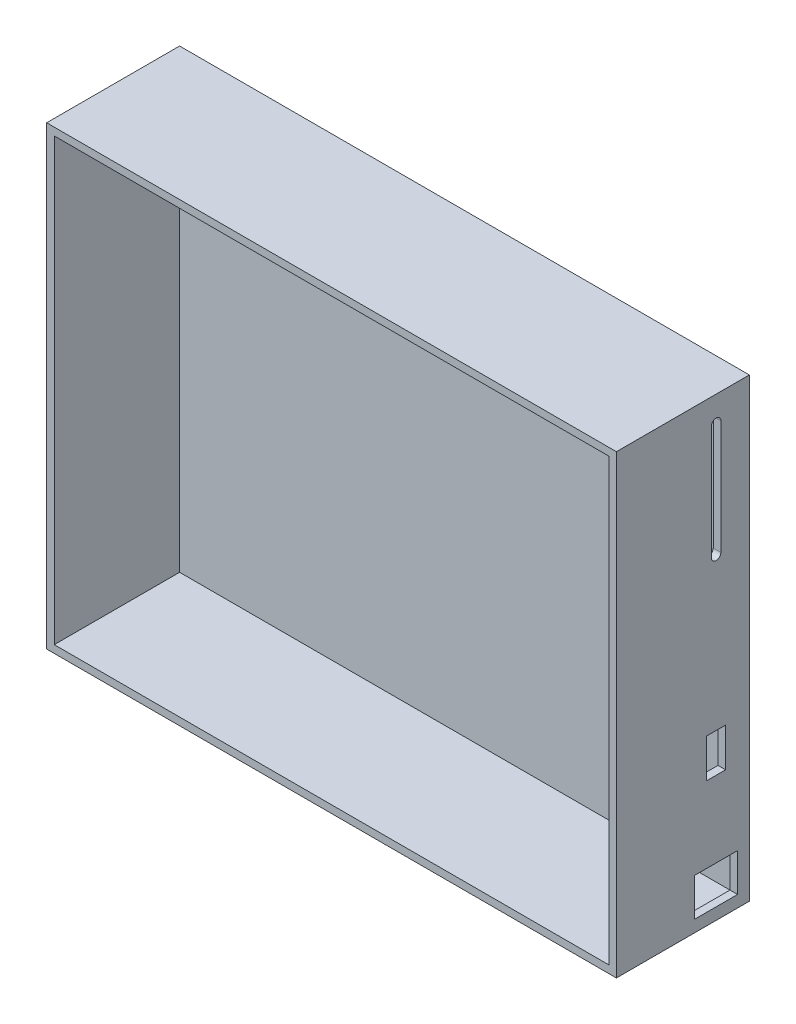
ISO-10303-21;
HEADER;
FILE_DESCRIPTION(('STEP AP214'),'2;1');
FILE_NAME('part.step','',(''),(''),'','','');
FILE_SCHEMA(('AUTOMOTIVE_DESIGN { 1 0 10303 214 1 1 1 1 }'));
ENDSEC;
DATA;
#1=APPLICATION_CONTEXT('core data for automotive mechanical design processes');
#2=APPLICATION_PROTOCOL_DEFINITION('international standard','automotive_design',2000,#1);
#3=PRODUCT_CONTEXT('',#1,'mechanical');
#4=PRODUCT('Part','Part','',(#3));
#5=PRODUCT_RELATED_PRODUCT_CATEGORY('part','',(#4));
#6=PRODUCT_DEFINITION_FORMATION('','',#4);
#7=PRODUCT_DEFINITION_CONTEXT('part definition',#1,'design');
#8=PRODUCT_DEFINITION('design','',#6,#7);
#9=PRODUCT_DEFINITION_SHAPE('','',#8);
#10=(LENGTH_UNIT() NAMED_UNIT(*) SI_UNIT(.MILLI.,.METRE.));
#11=(NAMED_UNIT(*) PLANE_ANGLE_UNIT() SI_UNIT($,.RADIAN.));
#12=(NAMED_UNIT(*) SI_UNIT($,.STERADIAN.) SOLID_ANGLE_UNIT());
#13=UNCERTAINTY_MEASURE_WITH_UNIT(LENGTH_MEASURE(1.E-05),#10,'distance_accuracy_value','');
#14=(GEOMETRIC_REPRESENTATION_CONTEXT(3) GLOBAL_UNCERTAINTY_ASSIGNED_CONTEXT((#13)) GLOBAL_UNIT_ASSIGNED_CONTEXT((#10,
#11,#12)) REPRESENTATION_CONTEXT('',''));
#15=CARTESIAN_POINT('',(0.,0.,0.));
#16=DIRECTION('',(0.,0.,1.));
#17=DIRECTION('',(1.,0.,0.));
#18=AXIS2_PLACEMENT_3D('',#15,#16,#17);
#19=CARTESIAN_POINT('',(-95.2500000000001,-76.2,22.225));
#20=DIRECTION('',(1.,0.,0.));
#21=DIRECTION('',(0.,0.,-1.));
#22=AXIS2_PLACEMENT_3D('',#19,#20,#21);
#23=PLANE('',#22);
#24=DIRECTION('',(0.,-1.,0.));
#25=VECTOR('',#24,1.);
#26=CARTESIAN_POINT('',(-95.2500000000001,-76.2,-22.225));
#27=LINE('',#26,#25);
#28=CARTESIAN_POINT('',(-95.2500000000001,76.2,-22.225));
#29=VERTEX_POINT('',#28);
#30=CARTESIAN_POINT('',(-95.2500000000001,-76.2,-22.225));
#31=VERTEX_POINT('',#30);
#32=EDGE_CURVE('E320',#29,#31,#27,.T.);
#33=ORIENTED_EDGE('',*,*,#32,.T.);
#34=DIRECTION('',(0.,0.,-1.));
#35=VECTOR('',#34,1.);
#36=CARTESIAN_POINT('',(-95.2500000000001,-76.2,22.225));
#37=LINE('',#36,#35);
#38=CARTESIAN_POINT('',(-95.2500000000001,-76.2,22.225));
#39=VERTEX_POINT('',#38);
#40=EDGE_CURVE('E11',#39,#31,#37,.T.);
#41=ORIENTED_EDGE('',*,*,#40,.F.);
#42=DIRECTION('',(0.,-1.,0.));
#43=VECTOR('',#42,1.);
#44=CARTESIAN_POINT('',(-95.2500000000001,-76.2,22.225));
#45=LINE('',#44,#43);
#46=CARTESIAN_POINT('',(-95.2500000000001,76.2,22.225));
#47=VERTEX_POINT('',#46);
#48=EDGE_CURVE('E354',#47,#39,#45,.T.);
#49=ORIENTED_EDGE('',*,*,#48,.F.);
#50=DIRECTION('',(0.,0.,-1.));
#51=VECTOR('',#50,1.);
#52=CARTESIAN_POINT('',(-95.2500000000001,76.2,22.225));
#53=LINE('',#52,#51);
#54=EDGE_CURVE('E368',#47,#29,#53,.T.);
#55=ORIENTED_EDGE('',*,*,#54,.T.);
#56=EDGE_LOOP('',(#33,#41,#49,#55));
#57=FACE_BOUND('',#56,.T.);
#58=ADVANCED_FACE('F39',(#57),#23,.F.);
#59=CARTESIAN_POINT('',(95.2499999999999,-76.2,22.225));
#60=DIRECTION('',(0.,1.,0.));
#61=DIRECTION('',(-1.,0.,0.));
#62=AXIS2_PLACEMENT_3D('',#59,#60,#61);
#63=PLANE('',#62);
#64=DIRECTION('',(1.,0.,0.));
#65=VECTOR('',#64,1.);
#66=CARTESIAN_POINT('',(95.2499999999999,-76.2,-22.225));
#67=LINE('',#66,#65);
#68=CARTESIAN_POINT('',(95.2499999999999,-76.2,-22.225));
#69=VERTEX_POINT('',#68);
#70=EDGE_CURVE('E372',#31,#69,#67,.T.);
#71=ORIENTED_EDGE('',*,*,#70,.T.);
#72=DIRECTION('',(0.,0.,-1.));
#73=VECTOR('',#72,1.);
#74=CARTESIAN_POINT('',(95.2499999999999,-76.2,22.225));
#75=LINE('',#74,#73);
#76=CARTESIAN_POINT('',(95.2499999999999,-76.2,22.225));
#77=VERTEX_POINT('',#76);
#78=EDGE_CURVE('E47',#77,#69,#75,.T.);
#79=ORIENTED_EDGE('',*,*,#78,.F.);
#80=DIRECTION('',(1.,0.,0.));
#81=VECTOR('',#80,1.);
#82=CARTESIAN_POINT('',(95.2499999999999,-76.2,22.225));
#83=LINE('',#82,#81);
#84=EDGE_CURVE('E358',#39,#77,#83,.T.);
#85=ORIENTED_EDGE('',*,*,#84,.F.);
#86=ORIENTED_EDGE('',*,*,#40,.T.);
#87=EDGE_LOOP('',(#71,#79,#85,#86));
#88=FACE_BOUND('',#87,.T.);
#89=ADVANCED_FACE('F408',(#88),#63,.F.);
#90=CARTESIAN_POINT('',(95.2499999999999,-76.2,22.225));
#91=DIRECTION('',(-1.,0.,0.));
#92=DIRECTION('',(0.,0.,1.));
#93=AXIS2_PLACEMENT_3D('',#90,#91,#92);
#94=PLANE('',#93);
#95=CARTESIAN_POINT('',(95.2499999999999,29.591,-11.1125));
#96=DIRECTION('',(1.,0.,0.));
#97=DIRECTION('',(0.,0.,-1.));
#98=AXIS2_PLACEMENT_3D('',#95,#96,#97);
#99=CIRCLE('',#98,1.58750000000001);
#100=CARTESIAN_POINT('',(95.2499999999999,29.591,-9.52500000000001));
#101=VERTEX_POINT('',#100);
#102=CARTESIAN_POINT('',(95.25,29.591,-12.7));
#103=VERTEX_POINT('',#102);
#104=EDGE_CURVE('E206',#101,#103,#99,.T.);
#105=ORIENTED_EDGE('',*,*,#104,.F.);
#106=DIRECTION('',(0.,-1.,0.));
#107=VECTOR('',#106,1.);
#108=CARTESIAN_POINT('',(95.2499999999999,67.6910000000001,-9.52500000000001));
#109=LINE('',#108,#107);
#110=CARTESIAN_POINT('',(95.2499999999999,67.6910000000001,-9.52500000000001));
#111=VERTEX_POINT('',#110);
#112=EDGE_CURVE('E196',#111,#101,#109,.T.);
#113=ORIENTED_EDGE('',*,*,#112,.F.);
#114=CARTESIAN_POINT('',(95.2499999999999,67.6910000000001,-11.1125));
#115=DIRECTION('',(1.,0.,0.));
#116=DIRECTION('',(0.,0.,-1.));
#117=AXIS2_PLACEMENT_3D('',#114,#115,#116);
#118=CIRCLE('',#117,1.5875);
#119=CARTESIAN_POINT('',(95.25,67.6910000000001,-12.7));
#120=VERTEX_POINT('',#119);
#121=EDGE_CURVE('E210',#120,#111,#118,.T.);
#122=ORIENTED_EDGE('',*,*,#121,.F.);
#123=DIRECTION('',(0.,1.,0.));
#124=VECTOR('',#123,1.);
#125=CARTESIAN_POINT('',(95.25,67.6910000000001,-12.7));
#126=LINE('',#125,#124);
#127=EDGE_CURVE('E54',#103,#120,#126,.T.);
#128=ORIENTED_EDGE('',*,*,#127,.F.);
#129=EDGE_LOOP('',(#105,#113,#122,#128));
#130=FACE_BOUND('',#129,.T.);
#131=DIRECTION('',(0.,-1.,0.));
#132=VECTOR('',#131,1.);
#133=CARTESIAN_POINT('',(95.2499999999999,-21.209,-7.93749999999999));
#134=LINE('',#133,#132);
#135=CARTESIAN_POINT('',(95.2499999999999,-21.209,-7.93749999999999));
#136=VERTEX_POINT('',#135);
#137=CARTESIAN_POINT('',(95.2499999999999,-34.163,-7.93749999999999));
#138=VERTEX_POINT('',#137);
#139=EDGE_CURVE('E229',#136,#138,#134,.T.);
#140=ORIENTED_EDGE('',*,*,#139,.F.);
#141=DIRECTION('',(0.,0.,1.));
#142=VECTOR('',#141,1.);
#143=CARTESIAN_POINT('',(95.2499999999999,-21.209,-7.93749999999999));
#144=LINE('',#143,#142);
#145=CARTESIAN_POINT('',(95.2499999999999,-21.209,-14.2875));
#146=VERTEX_POINT('',#145);
#147=EDGE_CURVE('E233',#146,#136,#144,.T.);
#148=ORIENTED_EDGE('',*,*,#147,.F.);
#149=DIRECTION('',(0.,1.,0.));
#150=VECTOR('',#149,1.);
#151=CARTESIAN_POINT('',(95.2499999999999,-21.209,-14.2875));
#152=LINE('',#151,#150);
#153=CARTESIAN_POINT('',(95.2499999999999,-34.163,-14.2875));
#154=VERTEX_POINT('',#153);
#155=EDGE_CURVE('E237',#154,#146,#152,.T.);
#156=ORIENTED_EDGE('',*,*,#155,.F.);
#157=DIRECTION('',(0.,0.,-1.));
#158=VECTOR('',#157,1.);
#159=CARTESIAN_POINT('',(95.2499999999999,-34.163,-7.93749999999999));
#160=LINE('',#159,#158);
#161=EDGE_CURVE('E62',#138,#154,#160,.T.);
#162=ORIENTED_EDGE('',*,*,#161,.F.);
#163=EDGE_LOOP('',(#140,#148,#156,#162));
#164=FACE_BOUND('',#163,.T.);
#165=DIRECTION('',(0.,-1.,0.));
#166=VECTOR('',#165,1.);
#167=CARTESIAN_POINT('',(95.2499999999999,-59.563,-3.93700000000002));
#168=LINE('',#167,#166);
#169=CARTESIAN_POINT('',(95.2499999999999,-59.563,-3.93700000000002));
#170=VERTEX_POINT('',#169);
#171=CARTESIAN_POINT('',(95.2499999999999,-72.263,-3.93700000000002));
#172=VERTEX_POINT('',#171);
#173=EDGE_CURVE('E273',#170,#172,#168,.T.);
#174=ORIENTED_EDGE('',*,*,#173,.F.);
#175=DIRECTION('',(0.,0.,1.));
#176=VECTOR('',#175,1.);
#177=CARTESIAN_POINT('',(95.2499999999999,-59.563,-3.93700000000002));
#178=LINE('',#177,#176);
#179=CARTESIAN_POINT('',(95.2499999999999,-59.563,-18.288));
#180=VERTEX_POINT('',#179);
#181=EDGE_CURVE('E277',#180,#170,#178,.T.);
#182=ORIENTED_EDGE('',*,*,#181,.F.);
#183=DIRECTION('',(0.,1.,0.));
#184=VECTOR('',#183,1.);
#185=CARTESIAN_POINT('',(95.2499999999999,-59.563,-18.288));
#186=LINE('',#185,#184);
#187=CARTESIAN_POINT('',(95.2499999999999,-72.263,-18.288));
#188=VERTEX_POINT('',#187);
#189=EDGE_CURVE('E281',#188,#180,#186,.T.);
#190=ORIENTED_EDGE('',*,*,#189,.F.);
#191=DIRECTION('',(0.,0.,-1.));
#192=VECTOR('',#191,1.);
#193=CARTESIAN_POINT('',(95.2499999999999,-72.263,-3.93700000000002));
#194=LINE('',#193,#192);
#195=EDGE_CURVE('E269',#172,#188,#194,.T.);
#196=ORIENTED_EDGE('',*,*,#195,.F.);
#197=EDGE_LOOP('',(#174,#182,#190,#196));
#198=FACE_BOUND('',#197,.T.);
#199=DIRECTION('',(0.,1.,0.));
#200=VECTOR('',#199,1.);
#201=CARTESIAN_POINT('',(95.2499999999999,-76.2,-22.225));
#202=LINE('',#201,#200);
#203=CARTESIAN_POINT('',(95.2499999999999,76.2,-22.225));
#204=VERTEX_POINT('',#203);
#205=EDGE_CURVE('E375',#69,#204,#202,.T.);
#206=ORIENTED_EDGE('',*,*,#205,.T.);
#207=DIRECTION('',(0.,0.,-1.));
#208=VECTOR('',#207,1.);
#209=CARTESIAN_POINT('',(95.2499999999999,76.2,22.225));
#210=LINE('',#209,#208);
#211=CARTESIAN_POINT('',(95.2499999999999,76.2,22.225));
#212=VERTEX_POINT('',#211);
#213=EDGE_CURVE('E383',#212,#204,#210,.T.);
#214=ORIENTED_EDGE('',*,*,#213,.F.);
#215=DIRECTION('',(0.,1.,0.));
#216=VECTOR('',#215,1.);
#217=CARTESIAN_POINT('',(95.2499999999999,-76.2,22.225));
#218=LINE('',#217,#216);
#219=EDGE_CURVE('E362',#77,#212,#218,.T.);
#220=ORIENTED_EDGE('',*,*,#219,.F.);
#221=ORIENTED_EDGE('',*,*,#78,.T.);
#222=EDGE_LOOP('',(#206,#214,#220,#221));
#223=FACE_BOUND('',#222,.T.);
#224=ADVANCED_FACE('F392',(#130,#164,#198,#223),#94,.F.);
#225=CARTESIAN_POINT('',(95.2499999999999,76.2,22.225));
#226=DIRECTION('',(0.,-1.,0.));
#227=DIRECTION('',(1.,0.,0.));
#228=AXIS2_PLACEMENT_3D('',#225,#226,#227);
#229=PLANE('',#228);
#230=DIRECTION('',(-1.,0.,0.));
#231=VECTOR('',#230,1.);
#232=CARTESIAN_POINT('',(95.2499999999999,76.2,-22.225));
#233=LINE('',#232,#231);
#234=EDGE_CURVE('E359',#204,#29,#233,.T.);
#235=ORIENTED_EDGE('',*,*,#234,.T.);
#236=ORIENTED_EDGE('',*,*,#54,.F.);
#237=DIRECTION('',(-1.,0.,0.));
#238=VECTOR('',#237,1.);
#239=CARTESIAN_POINT('',(95.2499999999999,76.2,22.225));
#240=LINE('',#239,#238);
#241=EDGE_CURVE('E365',#212,#47,#240,.T.);
#242=ORIENTED_EDGE('',*,*,#241,.F.);
#243=ORIENTED_EDGE('',*,*,#213,.T.);
#244=EDGE_LOOP('',(#235,#236,#242,#243));
#245=FACE_BOUND('',#244,.T.);
#246=ADVANCED_FACE('F401',(#245),#229,.F.);
#247=CARTESIAN_POINT('',(0.,0.,22.225));
#248=DIRECTION('',(0.,0.,1.));
#249=DIRECTION('',(1.,0.,0.));
#250=AXIS2_PLACEMENT_3D('',#247,#248,#249);
#251=PLANE('',#250);
#252=DIRECTION('',(0.,-1.,0.));
#253=VECTOR('',#252,1.);
#254=CARTESIAN_POINT('',(-92.7100000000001,-76.2,22.225));
#255=LINE('',#254,#253);
#256=CARTESIAN_POINT('',(-92.7100000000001,73.66,22.225));
#257=VERTEX_POINT('',#256);
#258=CARTESIAN_POINT('',(-92.7100000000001,-73.66,22.225));
#259=VERTEX_POINT('',#258);
#260=EDGE_CURVE('E342',#257,#259,#255,.T.);
#261=ORIENTED_EDGE('',*,*,#260,.F.);
#262=DIRECTION('',(-1.,0.,0.));
#263=VECTOR('',#262,1.);
#264=CARTESIAN_POINT('',(95.2499999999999,73.66,22.225));
#265=LINE('',#264,#263);
#266=CARTESIAN_POINT('',(92.71,73.66,22.225));
#267=VERTEX_POINT('',#266);
#268=EDGE_CURVE('E327',#267,#257,#265,.T.);
#269=ORIENTED_EDGE('',*,*,#268,.F.);
#270=DIRECTION('',(0.,1.,0.));
#271=VECTOR('',#270,1.);
#272=CARTESIAN_POINT('',(92.71,-76.2,22.225));
#273=LINE('',#272,#271);
#274=CARTESIAN_POINT('',(92.71,-73.66,22.225));
#275=VERTEX_POINT('',#274);
#276=EDGE_CURVE('E348',#275,#267,#273,.T.);
#277=ORIENTED_EDGE('',*,*,#276,.F.);
#278=DIRECTION('',(1.,0.,0.));
#279=VECTOR('',#278,1.);
#280=CARTESIAN_POINT('',(95.2499999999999,-73.66,22.225));
#281=LINE('',#280,#279);
#282=EDGE_CURVE('E345',#259,#275,#281,.T.);
#283=ORIENTED_EDGE('',*,*,#282,.F.);
#284=EDGE_LOOP('',(#261,#269,#277,#283));
#285=FACE_BOUND('',#284,.T.);
#286=ORIENTED_EDGE('',*,*,#48,.T.);
#287=ORIENTED_EDGE('',*,*,#84,.T.);
#288=ORIENTED_EDGE('',*,*,#219,.T.);
#289=ORIENTED_EDGE('',*,*,#241,.T.);
#290=EDGE_LOOP('',(#286,#287,#288,#289));
#291=FACE_BOUND('',#290,.T.);
#292=ADVANCED_FACE('F407',(#285,#291),#251,.T.);
#293=CARTESIAN_POINT('',(0.,0.,-22.225));
#294=DIRECTION('',(0.,0.,1.));
#295=DIRECTION('',(1.,0.,0.));
#296=AXIS2_PLACEMENT_3D('',#293,#294,#295);
#297=PLANE('',#296);
#298=ORIENTED_EDGE('',*,*,#32,.F.);
#299=ORIENTED_EDGE('',*,*,#234,.F.);
#300=ORIENTED_EDGE('',*,*,#205,.F.);
#301=ORIENTED_EDGE('',*,*,#70,.F.);
#302=EDGE_LOOP('',(#298,#299,#300,#301));
#303=FACE_BOUND('',#302,.T.);
#304=ADVANCED_FACE('F398',(#303),#297,.F.);
#305=CARTESIAN_POINT('',(-92.7100000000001,-76.2,22.225));
#306=DIRECTION('',(1.,0.,0.));
#307=DIRECTION('',(0.,0.,-1.));
#308=AXIS2_PLACEMENT_3D('',#305,#306,#307);
#309=PLANE('',#308);
#310=DIRECTION('',(0.,-1.,0.));
#311=VECTOR('',#310,1.);
#312=CARTESIAN_POINT('',(-92.7100000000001,-76.2,-19.685));
#313=LINE('',#312,#311);
#314=CARTESIAN_POINT('',(-92.7100000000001,73.66,-19.685));
#315=VERTEX_POINT('',#314);
#316=CARTESIAN_POINT('',(-92.7100000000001,-73.66,-19.685));
#317=VERTEX_POINT('',#316);
#318=EDGE_CURVE('E225',#315,#317,#313,.T.);
#319=ORIENTED_EDGE('',*,*,#318,.F.);
#320=DIRECTION('',(0.,0.,-1.));
#321=VECTOR('',#320,1.);
#322=CARTESIAN_POINT('',(-92.7100000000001,73.66,22.225));
#323=LINE('',#322,#321);
#324=EDGE_CURVE('E322',#257,#315,#323,.T.);
#325=ORIENTED_EDGE('',*,*,#324,.F.);
#326=ORIENTED_EDGE('',*,*,#260,.T.);
#327=DIRECTION('',(0.,0.,-1.));
#328=VECTOR('',#327,1.);
#329=CARTESIAN_POINT('',(-92.7100000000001,-73.66,22.225));
#330=LINE('',#329,#328);
#331=EDGE_CURVE('E316',#259,#317,#330,.T.);
#332=ORIENTED_EDGE('',*,*,#331,.T.);
#333=EDGE_LOOP('',(#319,#325,#326,#332));
#334=FACE_BOUND('',#333,.T.);
#335=ADVANCED_FACE('F421',(#334),#309,.T.);
#336=CARTESIAN_POINT('',(95.2499999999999,-73.66,22.225));
#337=DIRECTION('',(0.,1.,0.));
#338=DIRECTION('',(-1.,0.,0.));
#339=AXIS2_PLACEMENT_3D('',#336,#337,#338);
#340=PLANE('',#339);
#341=DIRECTION('',(1.,0.,0.));
#342=VECTOR('',#341,1.);
#343=CARTESIAN_POINT('',(95.2499999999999,-73.66,-19.685));
#344=LINE('',#343,#342);
#345=CARTESIAN_POINT('',(92.71,-73.66,-19.685));
#346=VERTEX_POINT('',#345);
#347=EDGE_CURVE('E315',#317,#346,#344,.T.);
#348=ORIENTED_EDGE('',*,*,#347,.F.);
#349=ORIENTED_EDGE('',*,*,#331,.F.);
#350=ORIENTED_EDGE('',*,*,#282,.T.);
#351=DIRECTION('',(0.,0.,-1.));
#352=VECTOR('',#351,1.);
#353=CARTESIAN_POINT('',(92.71,-73.66,22.225));
#354=LINE('',#353,#352);
#355=EDGE_CURVE('E321',#275,#346,#354,.T.);
#356=ORIENTED_EDGE('',*,*,#355,.T.);
#357=EDGE_LOOP('',(#348,#349,#350,#356));
#358=FACE_BOUND('',#357,.T.);
#359=ADVANCED_FACE('F436',(#358),#340,.T.);
#360=CARTESIAN_POINT('',(92.71,-76.2,22.225));
#361=DIRECTION('',(-1.,0.,0.));
#362=DIRECTION('',(0.,0.,1.));
#363=AXIS2_PLACEMENT_3D('',#360,#361,#362);
#364=PLANE('',#363);
#365=DIRECTION('',(0.,-1.,0.));
#366=VECTOR('',#365,1.);
#367=CARTESIAN_POINT('',(92.71,67.6910000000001,-9.52499999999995));
#368=LINE('',#367,#366);
#369=CARTESIAN_POINT('',(92.71,67.6910000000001,-9.52499999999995));
#370=VERTEX_POINT('',#369);
#371=CARTESIAN_POINT('',(92.71,29.591,-9.52499999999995));
#372=VERTEX_POINT('',#371);
#373=EDGE_CURVE('E193',#370,#372,#368,.T.);
#374=ORIENTED_EDGE('',*,*,#373,.T.);
#375=CARTESIAN_POINT('',(92.71,29.591,-11.1125));
#376=DIRECTION('',(-1.,0.,0.));
#377=DIRECTION('',(0.,0.,1.));
#378=AXIS2_PLACEMENT_3D('',#375,#376,#377);
#379=CIRCLE('',#378,1.58750000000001);
#380=CARTESIAN_POINT('',(92.71,29.591,-12.7));
#381=VERTEX_POINT('',#380);
#382=EDGE_CURVE('E178',#372,#381,#379,.F.);
#383=ORIENTED_EDGE('',*,*,#382,.T.);
#384=DIRECTION('',(0.,1.,0.));
#385=VECTOR('',#384,1.);
#386=CARTESIAN_POINT('',(92.71,67.6910000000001,-12.7));
#387=LINE('',#386,#385);
#388=CARTESIAN_POINT('',(92.71,67.6910000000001,-12.7));
#389=VERTEX_POINT('',#388);
#390=EDGE_CURVE('E216',#381,#389,#387,.T.);
#391=ORIENTED_EDGE('',*,*,#390,.T.);
#392=CARTESIAN_POINT('',(92.71,67.6910000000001,-11.1125));
#393=DIRECTION('',(-1.,0.,0.));
#394=DIRECTION('',(0.,0.,1.));
#395=AXIS2_PLACEMENT_3D('',#392,#393,#394);
#396=CIRCLE('',#395,1.5875);
#397=EDGE_CURVE('E202',#389,#370,#396,.F.);
#398=ORIENTED_EDGE('',*,*,#397,.T.);
#399=EDGE_LOOP('',(#374,#383,#391,#398));
#400=FACE_BOUND('',#399,.T.);
#401=DIRECTION('',(0.,0.,1.));
#402=VECTOR('',#401,1.);
#403=CARTESIAN_POINT('',(92.71,-21.209,-7.93749999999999));
#404=LINE('',#403,#402);
#405=CARTESIAN_POINT('',(92.71,-21.209,-14.2875));
#406=VERTEX_POINT('',#405);
#407=CARTESIAN_POINT('',(92.71,-21.209,-7.93749999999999));
#408=VERTEX_POINT('',#407);
#409=EDGE_CURVE('E228',#406,#408,#404,.T.);
#410=ORIENTED_EDGE('',*,*,#409,.T.);
#411=DIRECTION('',(0.,-1.,0.));
#412=VECTOR('',#411,1.);
#413=CARTESIAN_POINT('',(92.71,-21.209,-7.93749999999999));
#414=LINE('',#413,#412);
#415=CARTESIAN_POINT('',(92.71,-34.163,-7.93749999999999));
#416=VERTEX_POINT('',#415);
#417=EDGE_CURVE('E257',#408,#416,#414,.T.);
#418=ORIENTED_EDGE('',*,*,#417,.T.);
#419=DIRECTION('',(0.,0.,-1.));
#420=VECTOR('',#419,1.);
#421=CARTESIAN_POINT('',(92.71,-34.163,-7.93749999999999));
#422=LINE('',#421,#420);
#423=CARTESIAN_POINT('',(92.71,-34.163,-14.2875));
#424=VERTEX_POINT('',#423);
#425=EDGE_CURVE('E252',#416,#424,#422,.T.);
#426=ORIENTED_EDGE('',*,*,#425,.T.);
#427=DIRECTION('',(0.,1.,0.));
#428=VECTOR('',#427,1.);
#429=CARTESIAN_POINT('',(92.71,-21.209,-14.2875));
#430=LINE('',#429,#428);
#431=EDGE_CURVE('E246',#424,#406,#430,.T.);
#432=ORIENTED_EDGE('',*,*,#431,.T.);
#433=EDGE_LOOP('',(#410,#418,#426,#432));
#434=FACE_BOUND('',#433,.T.);
#435=DIRECTION('',(0.,0.,1.));
#436=VECTOR('',#435,1.);
#437=CARTESIAN_POINT('',(92.71,-59.563,-3.93699999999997));
#438=LINE('',#437,#436);
#439=CARTESIAN_POINT('',(92.71,-59.563,-18.288));
#440=VERTEX_POINT('',#439);
#441=CARTESIAN_POINT('',(92.71,-59.563,-3.93699999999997));
#442=VERTEX_POINT('',#441);
#443=EDGE_CURVE('E272',#440,#442,#438,.T.);
#444=ORIENTED_EDGE('',*,*,#443,.T.);
#445=DIRECTION('',(0.,-1.,0.));
#446=VECTOR('',#445,1.);
#447=CARTESIAN_POINT('',(92.71,-59.563,-3.93699999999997));
#448=LINE('',#447,#446);
#449=CARTESIAN_POINT('',(92.71,-72.263,-3.93699999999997));
#450=VERTEX_POINT('',#449);
#451=EDGE_CURVE('E299',#442,#450,#448,.T.);
#452=ORIENTED_EDGE('',*,*,#451,.T.);
#453=DIRECTION('',(0.,0.,-1.));
#454=VECTOR('',#453,1.);
#455=CARTESIAN_POINT('',(92.71,-72.263,-3.93699999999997));
#456=LINE('',#455,#454);
#457=CARTESIAN_POINT('',(92.71,-72.263,-18.288));
#458=VERTEX_POINT('',#457);
#459=EDGE_CURVE('E294',#450,#458,#456,.T.);
#460=ORIENTED_EDGE('',*,*,#459,.T.);
#461=DIRECTION('',(0.,1.,0.));
#462=VECTOR('',#461,1.);
#463=CARTESIAN_POINT('',(92.71,-59.563,-18.288));
#464=LINE('',#463,#462);
#465=EDGE_CURVE('E289',#458,#440,#464,.T.);
#466=ORIENTED_EDGE('',*,*,#465,.T.);
#467=EDGE_LOOP('',(#444,#452,#460,#466));
#468=FACE_BOUND('',#467,.T.);
#469=DIRECTION('',(0.,1.,0.));
#470=VECTOR('',#469,1.);
#471=CARTESIAN_POINT('',(92.71,-76.2,-19.685));
#472=LINE('',#471,#470);
#473=CARTESIAN_POINT('',(92.71,73.66,-19.685));
#474=VERTEX_POINT('',#473);
#475=EDGE_CURVE('E330',#346,#474,#472,.T.);
#476=ORIENTED_EDGE('',*,*,#475,.F.);
#477=ORIENTED_EDGE('',*,*,#355,.F.);
#478=ORIENTED_EDGE('',*,*,#276,.T.);
#479=DIRECTION('',(0.,0.,-1.));
#480=VECTOR('',#479,1.);
#481=CARTESIAN_POINT('',(92.71,73.66,22.225));
#482=LINE('',#481,#480);
#483=EDGE_CURVE('E326',#267,#474,#482,.T.);
#484=ORIENTED_EDGE('',*,*,#483,.T.);
#485=EDGE_LOOP('',(#476,#477,#478,#484));
#486=FACE_BOUND('',#485,.T.);
#487=ADVANCED_FACE('F200',(#400,#434,#468,#486),#364,.T.);
#488=CARTESIAN_POINT('',(95.2499999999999,73.66,22.225));
#489=DIRECTION('',(0.,-1.,0.));
#490=DIRECTION('',(1.,0.,0.));
#491=AXIS2_PLACEMENT_3D('',#488,#489,#490);
#492=PLANE('',#491);
#493=DIRECTION('',(-1.,0.,0.));
#494=VECTOR('',#493,1.);
#495=CARTESIAN_POINT('',(95.2499999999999,73.66,-19.685));
#496=LINE('',#495,#494);
#497=EDGE_CURVE('E336',#474,#315,#496,.T.);
#498=ORIENTED_EDGE('',*,*,#497,.F.);
#499=ORIENTED_EDGE('',*,*,#483,.F.);
#500=ORIENTED_EDGE('',*,*,#268,.T.);
#501=ORIENTED_EDGE('',*,*,#324,.T.);
#502=EDGE_LOOP('',(#498,#499,#500,#501));
#503=FACE_BOUND('',#502,.T.);
#504=ADVANCED_FACE('F429',(#503),#492,.T.);
#505=CARTESIAN_POINT('',(0.,0.,-19.685));
#506=DIRECTION('',(0.,0.,1.));
#507=DIRECTION('',(1.,0.,0.));
#508=AXIS2_PLACEMENT_3D('',#505,#506,#507);
#509=PLANE('',#508);
#510=ORIENTED_EDGE('',*,*,#318,.T.);
#511=ORIENTED_EDGE('',*,*,#347,.T.);
#512=ORIENTED_EDGE('',*,*,#475,.T.);
#513=ORIENTED_EDGE('',*,*,#497,.T.);
#514=EDGE_LOOP('',(#510,#511,#512,#513));
#515=FACE_BOUND('',#514,.T.);
#516=ADVANCED_FACE('F425',(#515),#509,.T.);
#517=CARTESIAN_POINT('',(51.3130647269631,-59.563,-3.93700000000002));
#518=DIRECTION('',(0.,1.,0.));
#519=DIRECTION('',(0.,0.,1.));
#520=AXIS2_PLACEMENT_3D('',#517,#518,#519);
#521=PLANE('',#520);
#522=DIRECTION('',(1.,0.,0.));
#523=VECTOR('',#522,1.);
#524=CARTESIAN_POINT('',(51.3130647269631,-59.563,-18.288));
#525=LINE('',#524,#523);
#526=EDGE_CURVE('E241',#440,#180,#525,.T.);
#527=ORIENTED_EDGE('',*,*,#526,.T.);
#528=ORIENTED_EDGE('',*,*,#181,.T.);
#529=DIRECTION('',(1.,0.,0.));
#530=VECTOR('',#529,1.);
#531=CARTESIAN_POINT('',(51.3130647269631,-59.563,-3.93700000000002));
#532=LINE('',#531,#530);
#533=EDGE_CURVE('E288',#442,#170,#532,.T.);
#534=ORIENTED_EDGE('',*,*,#533,.F.);
#535=ORIENTED_EDGE('',*,*,#443,.F.);
#536=EDGE_LOOP('',(#527,#528,#534,#535));
#537=FACE_BOUND('',#536,.T.);
#538=ADVANCED_FACE('F428',(#537),#521,.F.);
#539=CARTESIAN_POINT('',(51.3130647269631,-59.563,-3.93700000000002));
#540=DIRECTION('',(0.,0.,1.));
#541=DIRECTION('',(0.,-1.,0.));
#542=AXIS2_PLACEMENT_3D('',#539,#540,#541);
#543=PLANE('',#542);
#544=ORIENTED_EDGE('',*,*,#533,.T.);
#545=ORIENTED_EDGE('',*,*,#173,.T.);
#546=DIRECTION('',(1.,0.,0.));
#547=VECTOR('',#546,1.);
#548=CARTESIAN_POINT('',(51.3130647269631,-72.263,-3.93700000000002));
#549=LINE('',#548,#547);
#550=EDGE_CURVE('E298',#450,#172,#549,.T.);
#551=ORIENTED_EDGE('',*,*,#550,.F.);
#552=ORIENTED_EDGE('',*,*,#451,.F.);
#553=EDGE_LOOP('',(#544,#545,#551,#552));
#554=FACE_BOUND('',#553,.T.);
#555=ADVANCED_FACE('F445',(#554),#543,.F.);
#556=CARTESIAN_POINT('',(51.3130647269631,-72.263,-3.93700000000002));
#557=DIRECTION('',(0.,-1.,0.));
#558=DIRECTION('',(0.,0.,-1.));
#559=AXIS2_PLACEMENT_3D('',#556,#557,#558);
#560=PLANE('',#559);
#561=ORIENTED_EDGE('',*,*,#550,.T.);
#562=ORIENTED_EDGE('',*,*,#195,.T.);
#563=DIRECTION('',(1.,0.,0.));
#564=VECTOR('',#563,1.);
#565=CARTESIAN_POINT('',(51.3130647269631,-72.263,-18.288));
#566=LINE('',#565,#564);
#567=EDGE_CURVE('E293',#458,#188,#566,.T.);
#568=ORIENTED_EDGE('',*,*,#567,.F.);
#569=ORIENTED_EDGE('',*,*,#459,.F.);
#570=EDGE_LOOP('',(#561,#562,#568,#569));
#571=FACE_BOUND('',#570,.T.);
#572=ADVANCED_FACE('F449',(#571),#560,.F.);
#573=CARTESIAN_POINT('',(51.3130647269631,-59.563,-18.288));
#574=DIRECTION('',(0.,0.,-1.));
#575=DIRECTION('',(-1.,0.,0.));
#576=AXIS2_PLACEMENT_3D('',#573,#574,#575);
#577=PLANE('',#576);
#578=ORIENTED_EDGE('',*,*,#567,.T.);
#579=ORIENTED_EDGE('',*,*,#189,.T.);
#580=ORIENTED_EDGE('',*,*,#526,.F.);
#581=ORIENTED_EDGE('',*,*,#465,.F.);
#582=EDGE_LOOP('',(#578,#579,#580,#581));
#583=FACE_BOUND('',#582,.T.);
#584=ADVANCED_FACE('F453',(#583),#577,.F.);
#585=CARTESIAN_POINT('',(51.3130647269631,-21.209,-7.93750000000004));
#586=DIRECTION('',(0.,1.,0.));
#587=DIRECTION('',(0.,0.,1.));
#588=AXIS2_PLACEMENT_3D('',#585,#586,#587);
#589=PLANE('',#588);
#590=DIRECTION('',(1.,0.,0.));
#591=VECTOR('',#590,1.);
#592=CARTESIAN_POINT('',(51.3130647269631,-21.209,-14.2875));
#593=LINE('',#592,#591);
#594=EDGE_CURVE('E250',#406,#146,#593,.T.);
#595=ORIENTED_EDGE('',*,*,#594,.T.);
#596=ORIENTED_EDGE('',*,*,#147,.T.);
#597=DIRECTION('',(1.,0.,0.));
#598=VECTOR('',#597,1.);
#599=CARTESIAN_POINT('',(51.3130647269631,-21.209,-7.93750000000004));
#600=LINE('',#599,#598);
#601=EDGE_CURVE('E245',#408,#136,#600,.T.);
#602=ORIENTED_EDGE('',*,*,#601,.F.);
#603=ORIENTED_EDGE('',*,*,#409,.F.);
#604=EDGE_LOOP('',(#595,#596,#602,#603));
#605=FACE_BOUND('',#604,.T.);
#606=ADVANCED_FACE('F457',(#605),#589,.F.);
#607=CARTESIAN_POINT('',(51.3130647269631,-21.209,-7.93750000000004));
#608=DIRECTION('',(0.,0.,1.));
#609=DIRECTION('',(0.,-1.,0.));
#610=AXIS2_PLACEMENT_3D('',#607,#608,#609);
#611=PLANE('',#610);
#612=ORIENTED_EDGE('',*,*,#601,.T.);
#613=ORIENTED_EDGE('',*,*,#139,.T.);
#614=DIRECTION('',(1.,0.,0.));
#615=VECTOR('',#614,1.);
#616=CARTESIAN_POINT('',(51.3130647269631,-34.163,-7.93750000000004));
#617=LINE('',#616,#615);
#618=EDGE_CURVE('E256',#416,#138,#617,.T.);
#619=ORIENTED_EDGE('',*,*,#618,.F.);
#620=ORIENTED_EDGE('',*,*,#417,.F.);
#621=EDGE_LOOP('',(#612,#613,#619,#620));
#622=FACE_BOUND('',#621,.T.);
#623=ADVANCED_FACE('F461',(#622),#611,.F.);
#624=CARTESIAN_POINT('',(51.3130647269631,-34.163,-7.93750000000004));
#625=DIRECTION('',(0.,-1.,0.));
#626=DIRECTION('',(0.,0.,-1.));
#627=AXIS2_PLACEMENT_3D('',#624,#625,#626);
#628=PLANE('',#627);
#629=ORIENTED_EDGE('',*,*,#618,.T.);
#630=ORIENTED_EDGE('',*,*,#161,.T.);
#631=DIRECTION('',(1.,0.,0.));
#632=VECTOR('',#631,1.);
#633=CARTESIAN_POINT('',(51.3130647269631,-34.163,-14.2875));
#634=LINE('',#633,#632);
#635=EDGE_CURVE('E251',#424,#154,#634,.T.);
#636=ORIENTED_EDGE('',*,*,#635,.F.);
#637=ORIENTED_EDGE('',*,*,#425,.F.);
#638=EDGE_LOOP('',(#629,#630,#636,#637));
#639=FACE_BOUND('',#638,.T.);
#640=ADVANCED_FACE('F465',(#639),#628,.F.);
#641=CARTESIAN_POINT('',(51.3130647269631,-21.209,-14.2875));
#642=DIRECTION('',(0.,0.,-1.));
#643=DIRECTION('',(0.,1.,0.));
#644=AXIS2_PLACEMENT_3D('',#641,#642,#643);
#645=PLANE('',#644);
#646=ORIENTED_EDGE('',*,*,#635,.T.);
#647=ORIENTED_EDGE('',*,*,#155,.T.);
#648=ORIENTED_EDGE('',*,*,#594,.F.);
#649=ORIENTED_EDGE('',*,*,#431,.F.);
#650=EDGE_LOOP('',(#646,#647,#648,#649));
#651=FACE_BOUND('',#650,.T.);
#652=ADVANCED_FACE('F469',(#651),#645,.F.);
#653=CARTESIAN_POINT('',(51.3130647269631,67.6910000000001,-9.52500000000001));
#654=DIRECTION('',(0.,0.,1.));
#655=DIRECTION('',(0.,-1.,0.));
#656=AXIS2_PLACEMENT_3D('',#653,#654,#655);
#657=PLANE('',#656);
#658=DIRECTION('',(1.,0.,0.));
#659=VECTOR('',#658,1.);
#660=CARTESIAN_POINT('',(51.3130647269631,67.6910000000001,-9.52500000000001));
#661=LINE('',#660,#659);
#662=EDGE_CURVE('E214',#370,#111,#661,.T.);
#663=ORIENTED_EDGE('',*,*,#662,.T.);
#664=ORIENTED_EDGE('',*,*,#112,.T.);
#665=DIRECTION('',(1.,0.,0.));
#666=VECTOR('',#665,1.);
#667=CARTESIAN_POINT('',(51.3130647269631,29.591,-9.52500000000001));
#668=LINE('',#667,#666);
#669=EDGE_CURVE('E182',#372,#101,#668,.T.);
#670=ORIENTED_EDGE('',*,*,#669,.F.);
#671=ORIENTED_EDGE('',*,*,#373,.F.);
#672=EDGE_LOOP('',(#663,#664,#670,#671));
#673=FACE_BOUND('',#672,.T.);
#674=ADVANCED_FACE('F192',(#673),#657,.F.);
#675=CARTESIAN_POINT('',(51.3130647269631,29.591,-11.1125));
#676=DIRECTION('',(1.,0.,0.));
#677=DIRECTION('',(0.,0.,-1.));
#678=AXIS2_PLACEMENT_3D('',#675,#676,#677);
#679=CYLINDRICAL_SURFACE('',#678,1.58750000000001);
#680=ORIENTED_EDGE('',*,*,#669,.T.);
#681=ORIENTED_EDGE('',*,*,#104,.T.);
#682=DIRECTION('',(1.,0.,0.));
#683=VECTOR('',#682,1.);
#684=CARTESIAN_POINT('',(51.3130647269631,29.591,-12.7));
#685=LINE('',#684,#683);
#686=EDGE_CURVE('E184',#381,#103,#685,.T.);
#687=ORIENTED_EDGE('',*,*,#686,.F.);
#688=ORIENTED_EDGE('',*,*,#382,.F.);
#689=EDGE_LOOP('',(#680,#681,#687,#688));
#690=FACE_BOUND('',#689,.T.);
#691=ADVANCED_FACE('F180',(#690),#679,.F.);
#692=CARTESIAN_POINT('',(51.3130647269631,67.6910000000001,-12.7));
#693=DIRECTION('',(0.,0.,-1.));
#694=DIRECTION('',(0.,1.,0.));
#695=AXIS2_PLACEMENT_3D('',#692,#693,#694);
#696=PLANE('',#695);
#697=ORIENTED_EDGE('',*,*,#686,.T.);
#698=ORIENTED_EDGE('',*,*,#127,.T.);
#699=DIRECTION('',(1.,0.,0.));
#700=VECTOR('',#699,1.);
#701=CARTESIAN_POINT('',(51.3130647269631,67.6910000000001,-12.7));
#702=LINE('',#701,#700);
#703=EDGE_CURVE('E215',#389,#120,#702,.T.);
#704=ORIENTED_EDGE('',*,*,#703,.F.);
#705=ORIENTED_EDGE('',*,*,#390,.F.);
#706=EDGE_LOOP('',(#697,#698,#704,#705));
#707=FACE_BOUND('',#706,.T.);
#708=ADVANCED_FACE('F477',(#707),#696,.F.);
#709=CARTESIAN_POINT('',(51.3130647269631,67.6910000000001,-11.1125));
#710=DIRECTION('',(1.,0.,0.));
#711=DIRECTION('',(0.,0.,-1.));
#712=AXIS2_PLACEMENT_3D('',#709,#710,#711);
#713=CYLINDRICAL_SURFACE('',#712,1.5875);
#714=ORIENTED_EDGE('',*,*,#703,.T.);
#715=ORIENTED_EDGE('',*,*,#121,.T.);
#716=ORIENTED_EDGE('',*,*,#662,.F.);
#717=ORIENTED_EDGE('',*,*,#397,.F.);
#718=EDGE_LOOP('',(#714,#715,#716,#717));
#719=FACE_BOUND('',#718,.T.);
#720=ADVANCED_FACE('F480',(#719),#713,.F.);
#721=CLOSED_SHELL('',(#58,#89,#224,#246,#292,#304,#335,#359,#487,#504,#516,#538,#555,#572,#584,
#606,#623,#640,#652,#674,#691,#708,#720));
#722=MANIFOLD_SOLID_BREP('B2',#721);
#723=ADVANCED_BREP_SHAPE_REPRESENTATION('',(#18,#722),#14);
#724=SHAPE_DEFINITION_REPRESENTATION(#9,#723);
ENDSEC;
END-ISO-10303-21;
